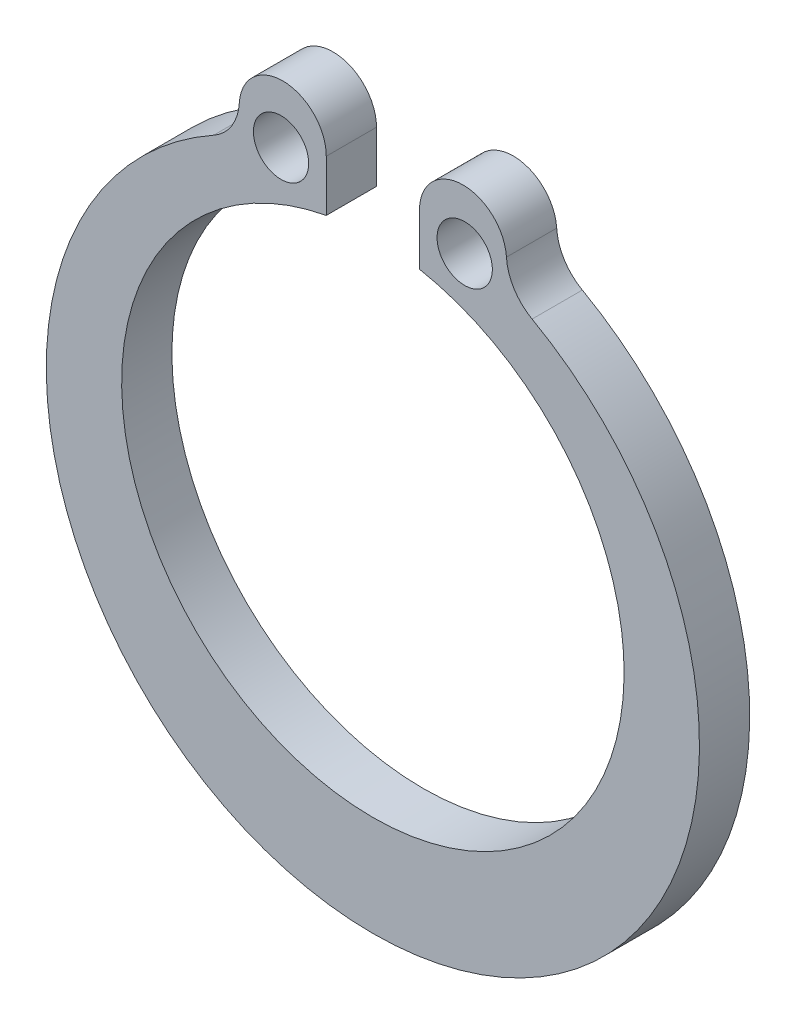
from build123d import *

# Parameters (mm, degrees)
EXTRUSION1_DEPTH        = 1
CONG_1_R                = 1
ESQUISSE2_R             = 0.55
ENL_V_MAT_EXTRU_1_DEPTH = 1


with BuildPart() as part:
    # Esquisse1 → Extrusion1 (new body)
    with BuildSketch(Plane.XY):
        with BuildLine():
            Line((-0.927516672, 5.933483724), (-0.927516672, 4.913218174))
            ThreePointArc((-0.927516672, 4.913218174), (0, -5), (0.927516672, 4.913218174))
            Line((0.927516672, 4.913218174), (0.927516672, 5.933483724))
            ThreePointArc((0.927516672, 5.933483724), (2.026373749, 6.767877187), (2.534993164, 5.485299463))
            ThreePointArc((2.534993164, 5.485299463), (0, -7), (-2.534993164, 5.485299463))
            ThreePointArc((-2.534993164, 5.485299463), (-2.026373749, 6.767877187), (-0.927516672, 5.933483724))
        make_face()
    extrude(amount=EXTRUSION1_DEPTH)

    # Cong_1
    cong_1_edges = [part.edges().sort_by_distance(p)[0] for p in [
        (2.534993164, 5.485299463, 0.5),
        (-2.534993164, 5.485299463, 0.5),
    ]]
    fillet(cong_1_edges, radius=CONG_1_R)

    # Esquisse2 → Enl_v. mat.-Extru.1 (cut)
    with BuildSketch(Plane.XY.offset(1)):
        with Locations((-1.827516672, 5.633233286)):
            Circle(ESQUISSE2_R)
    enl_v_mat_extru_1 = extrude(amount=-ENL_V_MAT_EXTRU_1_DEPTH, mode=Mode.SUBTRACT)

    # Sym_trie1: Enl_v. mat.-Extru.1 across plane
    add(enl_v_mat_extru_1.mirror(Plane(origin=(0, 0, 0), x_dir=(0, 0, 1), z_dir=(1, 0, 0))), mode=Mode.SUBTRACT)


solid = part.part
